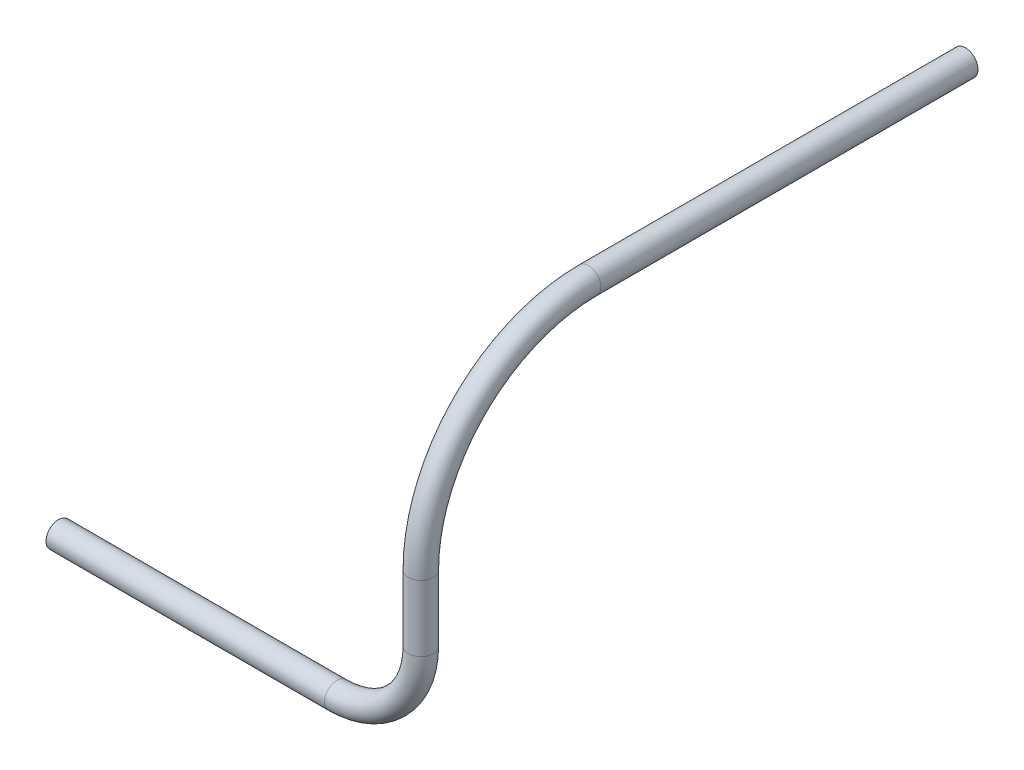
ISO-10303-21;
HEADER;
FILE_DESCRIPTION(('STEP AP214'),'2;1');
FILE_NAME('part.step','',(''),(''),'','','');
FILE_SCHEMA(('AUTOMOTIVE_DESIGN { 1 0 10303 214 1 1 1 1 }'));
ENDSEC;
DATA;
#1=APPLICATION_CONTEXT('core data for automotive mechanical design processes');
#2=APPLICATION_PROTOCOL_DEFINITION('international standard','automotive_design',2000,#1);
#3=PRODUCT_CONTEXT('',#1,'mechanical');
#4=PRODUCT('Part','Part','',(#3));
#5=PRODUCT_RELATED_PRODUCT_CATEGORY('part','',(#4));
#6=PRODUCT_DEFINITION_FORMATION('','',#4);
#7=PRODUCT_DEFINITION_CONTEXT('part definition',#1,'design');
#8=PRODUCT_DEFINITION('design','',#6,#7);
#9=PRODUCT_DEFINITION_SHAPE('','',#8);
#10=(LENGTH_UNIT() NAMED_UNIT(*) SI_UNIT(.MILLI.,.METRE.));
#11=(NAMED_UNIT(*) PLANE_ANGLE_UNIT() SI_UNIT($,.RADIAN.));
#12=(NAMED_UNIT(*) SI_UNIT($,.STERADIAN.) SOLID_ANGLE_UNIT());
#13=UNCERTAINTY_MEASURE_WITH_UNIT(LENGTH_MEASURE(1.E-05),#10,'distance_accuracy_value','');
#14=(GEOMETRIC_REPRESENTATION_CONTEXT(3) GLOBAL_UNCERTAINTY_ASSIGNED_CONTEXT((#13)) GLOBAL_UNIT_ASSIGNED_CONTEXT((#10,
#11,#12)) REPRESENTATION_CONTEXT('',''));
#15=CARTESIAN_POINT('',(0.,0.,0.));
#16=DIRECTION('',(0.,0.,1.));
#17=DIRECTION('',(1.,0.,0.));
#18=AXIS2_PLACEMENT_3D('',#15,#16,#17);
#19=CARTESIAN_POINT('',(-38.0999999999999,-38.0999999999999,114.3));
#20=DIRECTION('',(1.,0.,0.));
#21=DIRECTION('',(0.,0.,-1.));
#22=AXIS2_PLACEMENT_3D('',#19,#20,#21);
#23=TOROIDAL_SURFACE('',#22,50.8,3.81);
#24=CARTESIAN_POINT('',(-38.0999999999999,12.7000000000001,114.3));
#25=DIRECTION('',(0.,0.,1.));
#26=DIRECTION('',(1.,0.,0.));
#27=AXIS2_PLACEMENT_3D('',#24,#25,#26);
#28=CIRCLE('',#27,3.81);
#29=CARTESIAN_POINT('',(-38.0999999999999,16.5100000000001,114.3));
#30=VERTEX_POINT('',#29);
#31=EDGE_CURVE('E35',#30,#30,#28,.T.);
#32=CARTESIAN_POINT('',(-38.0999999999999,-38.1,165.1));
#33=DIRECTION('',(0.,-1.,0.));
#34=DIRECTION('',(1.,0.,0.));
#35=AXIS2_PLACEMENT_3D('',#32,#33,#34);
#36=CIRCLE('',#35,3.81);
#37=CARTESIAN_POINT('',(-38.0999999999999,-38.1,168.91));
#38=VERTEX_POINT('',#37);
#39=EDGE_CURVE('E10',#38,#38,#36,.T.);
#40=CARTESIAN_POINT('',(-38.0999999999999,-38.0999999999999,114.3));
#41=DIRECTION('',(1.,0.,0.));
#42=DIRECTION('',(0.,0.,-1.));
#43=AXIS2_PLACEMENT_3D('',#40,#41,#42);
#44=CIRCLE('',#43,54.61);
#45=EDGE_CURVE('',#30,#38,#44,.T.);
#46=ORIENTED_EDGE('',*,*,#31,.T.);
#47=ORIENTED_EDGE('',*,*,#39,.F.);
#48=ORIENTED_EDGE('',*,*,#45,.T.);
#49=ORIENTED_EDGE('',*,*,#45,.F.);
#50=EDGE_LOOP('',(#46,#48,#47,#49));
#51=FACE_BOUND('',#50,.T.);
#52=ADVANCED_FACE('F29',(#51),#23,.T.);
#53=CARTESIAN_POINT('',(-38.0999999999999,12.7000000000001,114.3));
#54=DIRECTION('',(0.,0.,-1.));
#55=DIRECTION('',(-1.,0.,0.));
#56=AXIS2_PLACEMENT_3D('',#53,#54,#55);
#57=CYLINDRICAL_SURFACE('',#56,3.81);
#58=ORIENTED_EDGE('',*,*,#31,.F.);
#59=EDGE_LOOP('',(#58));
#60=FACE_BOUND('',#59,.T.);
#61=CARTESIAN_POINT('',(-38.0999999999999,12.7000000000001,0.));
#62=DIRECTION('',(0.,0.,1.));
#63=DIRECTION('',(1.,0.,0.));
#64=AXIS2_PLACEMENT_3D('',#61,#62,#63);
#65=CIRCLE('',#64,3.81);
#66=CARTESIAN_POINT('',(-34.2899999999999,12.7000000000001,0.));
#67=VERTEX_POINT('',#66);
#68=EDGE_CURVE('E39',#67,#67,#65,.T.);
#69=ORIENTED_EDGE('',*,*,#68,.T.);
#70=EDGE_LOOP('',(#69));
#71=FACE_BOUND('',#70,.T.);
#72=ADVANCED_FACE('F71',(#60,#71),#57,.T.);
#73=CARTESIAN_POINT('',(-38.0999999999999,12.7000000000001,0.));
#74=DIRECTION('',(0.,0.,1.));
#75=DIRECTION('',(1.,0.,0.));
#76=AXIS2_PLACEMENT_3D('',#73,#74,#75);
#77=PLANE('',#76);
#78=ORIENTED_EDGE('',*,*,#68,.F.);
#79=EDGE_LOOP('',(#78));
#80=FACE_BOUND('',#79,.T.);
#81=ADVANCED_FACE('F75',(#80),#77,.F.);
#82=CARTESIAN_POINT('',(-63.4999999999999,-83.5024999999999,165.1));
#83=DIRECTION('',(-1.,0.,0.));
#84=DIRECTION('',(0.,-1.,0.));
#85=AXIS2_PLACEMENT_3D('',#82,#83,#84);
#86=CYLINDRICAL_SURFACE('',#85,3.81);
#87=CARTESIAN_POINT('',(-63.4999999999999,-83.5024999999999,165.1));
#88=DIRECTION('',(-1.,0.,0.));
#89=DIRECTION('',(0.,0.,-1.));
#90=AXIS2_PLACEMENT_3D('',#87,#88,#89);
#91=CIRCLE('',#90,3.81);
#92=CARTESIAN_POINT('',(-63.4999999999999,-87.3124999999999,165.1));
#93=VERTEX_POINT('',#92);
#94=EDGE_CURVE('E48',#93,#93,#91,.T.);
#95=ORIENTED_EDGE('',*,*,#94,.T.);
#96=EDGE_LOOP('',(#95));
#97=FACE_BOUND('',#96,.T.);
#98=CARTESIAN_POINT('',(-147.913662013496,-83.5024999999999,165.1));
#99=DIRECTION('',(-1.,0.,0.));
#100=DIRECTION('',(0.,0.,-1.));
#101=AXIS2_PLACEMENT_3D('',#98,#99,#100);
#102=CIRCLE('',#101,3.81);
#103=CARTESIAN_POINT('',(-147.913662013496,-83.5024999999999,161.29));
#104=VERTEX_POINT('',#103);
#105=EDGE_CURVE('E44',#104,#104,#102,.T.);
#106=ORIENTED_EDGE('',*,*,#105,.F.);
#107=EDGE_LOOP('',(#106));
#108=FACE_BOUND('',#107,.T.);
#109=ADVANCED_FACE('F68',(#97,#108),#86,.T.);
#110=CARTESIAN_POINT('',(-63.4999999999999,-58.1024999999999,165.1));
#111=DIRECTION('',(0.,0.,-1.));
#112=DIRECTION('',(0.,1.,0.));
#113=AXIS2_PLACEMENT_3D('',#110,#111,#112);
#114=TOROIDAL_SURFACE('',#113,25.4,3.81);
#115=CARTESIAN_POINT('',(-38.0999999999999,-58.1024999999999,165.1));
#116=DIRECTION('',(0.,-1.,0.));
#117=DIRECTION('',(0.,0.,-1.));
#118=AXIS2_PLACEMENT_3D('',#115,#116,#117);
#119=CIRCLE('',#118,3.81);
#120=CARTESIAN_POINT('',(-34.2899999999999,-58.1024999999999,165.1));
#121=VERTEX_POINT('',#120);
#122=EDGE_CURVE('E51',#121,#121,#119,.T.);
#123=CARTESIAN_POINT('',(-63.4999999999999,-58.1024999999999,165.1));
#124=DIRECTION('',(0.,0.,-1.));
#125=DIRECTION('',(0.,1.,0.));
#126=AXIS2_PLACEMENT_3D('',#123,#124,#125);
#127=CIRCLE('',#126,29.21);
#128=EDGE_CURVE('',#121,#93,#127,.T.);
#129=ORIENTED_EDGE('',*,*,#122,.T.);
#130=ORIENTED_EDGE('',*,*,#94,.F.);
#131=ORIENTED_EDGE('',*,*,#128,.T.);
#132=ORIENTED_EDGE('',*,*,#128,.F.);
#133=EDGE_LOOP('',(#129,#131,#130,#132));
#134=FACE_BOUND('',#133,.T.);
#135=ADVANCED_FACE('F55',(#134),#114,.T.);
#136=CARTESIAN_POINT('',(-38.0999999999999,-58.1024999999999,165.1));
#137=DIRECTION('',(0.,1.,0.));
#138=DIRECTION('',(-1.,0.,0.));
#139=AXIS2_PLACEMENT_3D('',#136,#137,#138);
#140=CYLINDRICAL_SURFACE('',#139,3.81);
#141=ORIENTED_EDGE('',*,*,#122,.F.);
#142=EDGE_LOOP('',(#141));
#143=FACE_BOUND('',#142,.T.);
#144=ORIENTED_EDGE('',*,*,#39,.T.);
#145=EDGE_LOOP('',(#144));
#146=FACE_BOUND('',#145,.T.);
#147=ADVANCED_FACE('F58',(#143,#146),#140,.T.);
#148=CARTESIAN_POINT('',(-147.913662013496,-83.5024999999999,165.1));
#149=DIRECTION('',(-1.,0.,0.));
#150=DIRECTION('',(0.,0.,-1.));
#151=AXIS2_PLACEMENT_3D('',#148,#149,#150);
#152=PLANE('',#151);
#153=ORIENTED_EDGE('',*,*,#105,.T.);
#154=EDGE_LOOP('',(#153));
#155=FACE_BOUND('',#154,.T.);
#156=ADVANCED_FACE('F60',(#155),#152,.T.);
#157=CLOSED_SHELL('',(#52,#72,#81,#109,#135,#147,#156));
#158=MANIFOLD_SOLID_BREP('B2',#157);
#159=ADVANCED_BREP_SHAPE_REPRESENTATION('',(#18,#158),#14);
#160=SHAPE_DEFINITION_REPRESENTATION(#9,#159);
ENDSEC;
END-ISO-10303-21;
